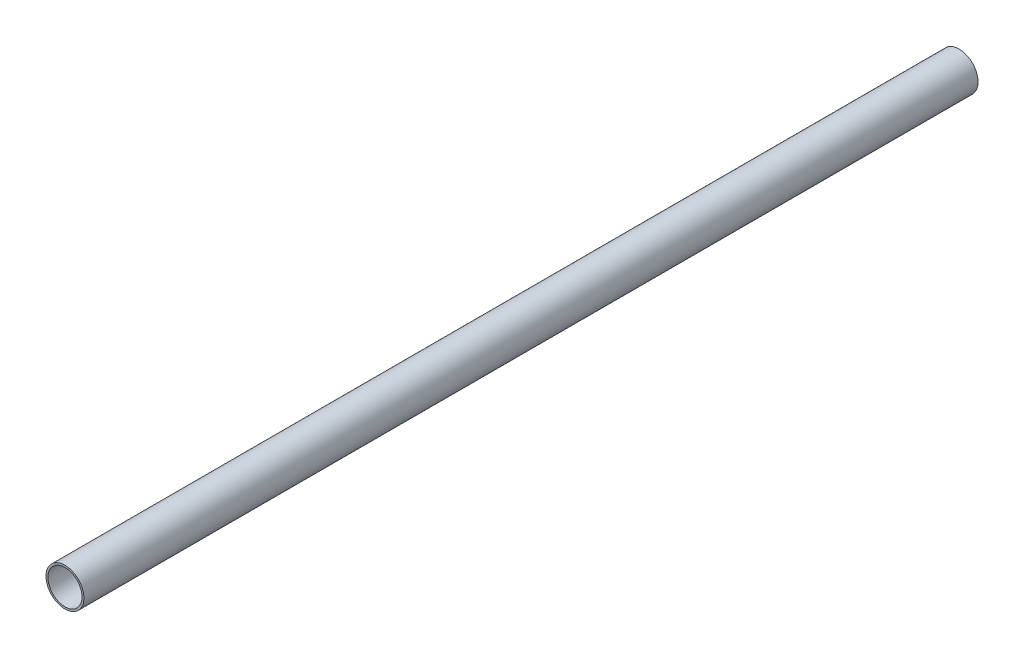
ISO-10303-21;
HEADER;
FILE_DESCRIPTION(('STEP AP214'),'2;1');
FILE_NAME('part.step','',(''),(''),'','','');
FILE_SCHEMA(('AUTOMOTIVE_DESIGN { 1 0 10303 214 1 1 1 1 }'));
ENDSEC;
DATA;
#1=APPLICATION_CONTEXT('core data for automotive mechanical design processes');
#2=APPLICATION_PROTOCOL_DEFINITION('international standard','automotive_design',2000,#1);
#3=PRODUCT_CONTEXT('',#1,'mechanical');
#4=PRODUCT('Part','Part','',(#3));
#5=PRODUCT_RELATED_PRODUCT_CATEGORY('part','',(#4));
#6=PRODUCT_DEFINITION_FORMATION('','',#4);
#7=PRODUCT_DEFINITION_CONTEXT('part definition',#1,'design');
#8=PRODUCT_DEFINITION('design','',#6,#7);
#9=PRODUCT_DEFINITION_SHAPE('','',#8);
#10=(LENGTH_UNIT() NAMED_UNIT(*) SI_UNIT(.MILLI.,.METRE.));
#11=(NAMED_UNIT(*) PLANE_ANGLE_UNIT() SI_UNIT($,.RADIAN.));
#12=(NAMED_UNIT(*) SI_UNIT($,.STERADIAN.) SOLID_ANGLE_UNIT());
#13=UNCERTAINTY_MEASURE_WITH_UNIT(LENGTH_MEASURE(1.E-05),#10,'distance_accuracy_value','');
#14=(GEOMETRIC_REPRESENTATION_CONTEXT(3) GLOBAL_UNCERTAINTY_ASSIGNED_CONTEXT((#13)) GLOBAL_UNIT_ASSIGNED_CONTEXT((#10,
#11,#12)) REPRESENTATION_CONTEXT('',''));
#15=CARTESIAN_POINT('',(0.,0.,0.));
#16=DIRECTION('',(0.,0.,1.));
#17=DIRECTION('',(1.,0.,0.));
#18=AXIS2_PLACEMENT_3D('',#15,#16,#17);
#19=CARTESIAN_POINT('',(0.,0.,26.079999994));
#20=DIRECTION('',(0.,0.,-1.));
#21=DIRECTION('',(-1.,0.,0.));
#22=AXIS2_PLACEMENT_3D('',#19,#20,#21);
#23=CYLINDRICAL_SURFACE('',#22,27.);
#24=CARTESIAN_POINT('',(0.,0.,424.279999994));
#25=DIRECTION('',(0.,0.,-1.));
#26=DIRECTION('',(-1.,0.,0.));
#27=AXIS2_PLACEMENT_3D('',#24,#25,#26);
#28=CIRCLE('',#27,27.);
#29=CARTESIAN_POINT('',(-27.,0.,424.279999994));
#30=VERTEX_POINT('',#29);
#31=EDGE_CURVE('E35',#30,#30,#28,.T.);
#32=ORIENTED_EDGE('',*,*,#31,.F.);
#33=EDGE_LOOP('',(#32));
#34=FACE_BOUND('',#33,.T.);
#35=CARTESIAN_POINT('',(0.,0.,-990.4));
#36=DIRECTION('',(0.,0.,-1.));
#37=DIRECTION('',(-1.,0.,0.));
#38=AXIS2_PLACEMENT_3D('',#35,#36,#37);
#39=CIRCLE('',#38,27.);
#40=CARTESIAN_POINT('',(-27.,0.,-990.4));
#41=VERTEX_POINT('',#40);
#42=EDGE_CURVE('E46',#41,#41,#39,.T.);
#43=ORIENTED_EDGE('',*,*,#42,.T.);
#44=EDGE_LOOP('',(#43));
#45=FACE_BOUND('',#44,.T.);
#46=ADVANCED_FACE('F32',(#34,#45),#23,.F.);
#47=CARTESIAN_POINT('',(0.,0.,424.279999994));
#48=DIRECTION('',(0.,0.,1.));
#49=DIRECTION('',(1.,0.,0.));
#50=AXIS2_PLACEMENT_3D('',#47,#48,#49);
#51=PLANE('',#50);
#52=ORIENTED_EDGE('',*,*,#31,.T.);
#53=EDGE_LOOP('',(#52));
#54=FACE_BOUND('',#53,.T.);
#55=CARTESIAN_POINT('',(0.,0.,424.279999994));
#56=DIRECTION('',(0.,0.,-1.));
#57=DIRECTION('',(-1.,0.,0.));
#58=AXIS2_PLACEMENT_3D('',#55,#56,#57);
#59=CIRCLE('',#58,30.);
#60=CARTESIAN_POINT('',(-30.,0.,424.279999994));
#61=VERTEX_POINT('',#60);
#62=EDGE_CURVE('E10',#61,#61,#59,.T.);
#63=ORIENTED_EDGE('',*,*,#62,.F.);
#64=EDGE_LOOP('',(#63));
#65=FACE_BOUND('',#64,.T.);
#66=ADVANCED_FACE('F59',(#54,#65),#51,.T.);
#67=CARTESIAN_POINT('',(0.,0.,26.079999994));
#68=DIRECTION('',(0.,0.,-1.));
#69=DIRECTION('',(-1.,0.,0.));
#70=AXIS2_PLACEMENT_3D('',#67,#68,#69);
#71=CYLINDRICAL_SURFACE('',#70,30.);
#72=ORIENTED_EDGE('',*,*,#62,.T.);
#73=EDGE_LOOP('',(#72));
#74=FACE_BOUND('',#73,.T.);
#75=CARTESIAN_POINT('',(0.,0.,-990.4));
#76=DIRECTION('',(0.,0.,-1.));
#77=DIRECTION('',(-1.,0.,0.));
#78=AXIS2_PLACEMENT_3D('',#75,#76,#77);
#79=CIRCLE('',#78,30.);
#80=CARTESIAN_POINT('',(-30.,0.,-990.4));
#81=VERTEX_POINT('',#80);
#82=EDGE_CURVE('E42',#81,#81,#79,.F.);
#83=ORIENTED_EDGE('',*,*,#82,.T.);
#84=EDGE_LOOP('',(#83));
#85=FACE_BOUND('',#84,.T.);
#86=ADVANCED_FACE('F54',(#74,#85),#71,.T.);
#87=CARTESIAN_POINT('',(0.,0.,-990.4));
#88=DIRECTION('',(0.,0.,1.));
#89=DIRECTION('',(1.,0.,0.));
#90=AXIS2_PLACEMENT_3D('',#87,#88,#89);
#91=PLANE('',#90);
#92=ORIENTED_EDGE('',*,*,#42,.F.);
#93=EDGE_LOOP('',(#92));
#94=FACE_BOUND('',#93,.T.);
#95=ORIENTED_EDGE('',*,*,#82,.F.);
#96=EDGE_LOOP('',(#95));
#97=FACE_BOUND('',#96,.T.);
#98=ADVANCED_FACE('F51',(#94,#97),#91,.F.);
#99=CLOSED_SHELL('',(#46,#66,#86,#98));
#100=MANIFOLD_SOLID_BREP('B2',#99);
#101=ADVANCED_BREP_SHAPE_REPRESENTATION('',(#18,#100),#14);
#102=SHAPE_DEFINITION_REPRESENTATION(#9,#101);
ENDSEC;
END-ISO-10303-21;
